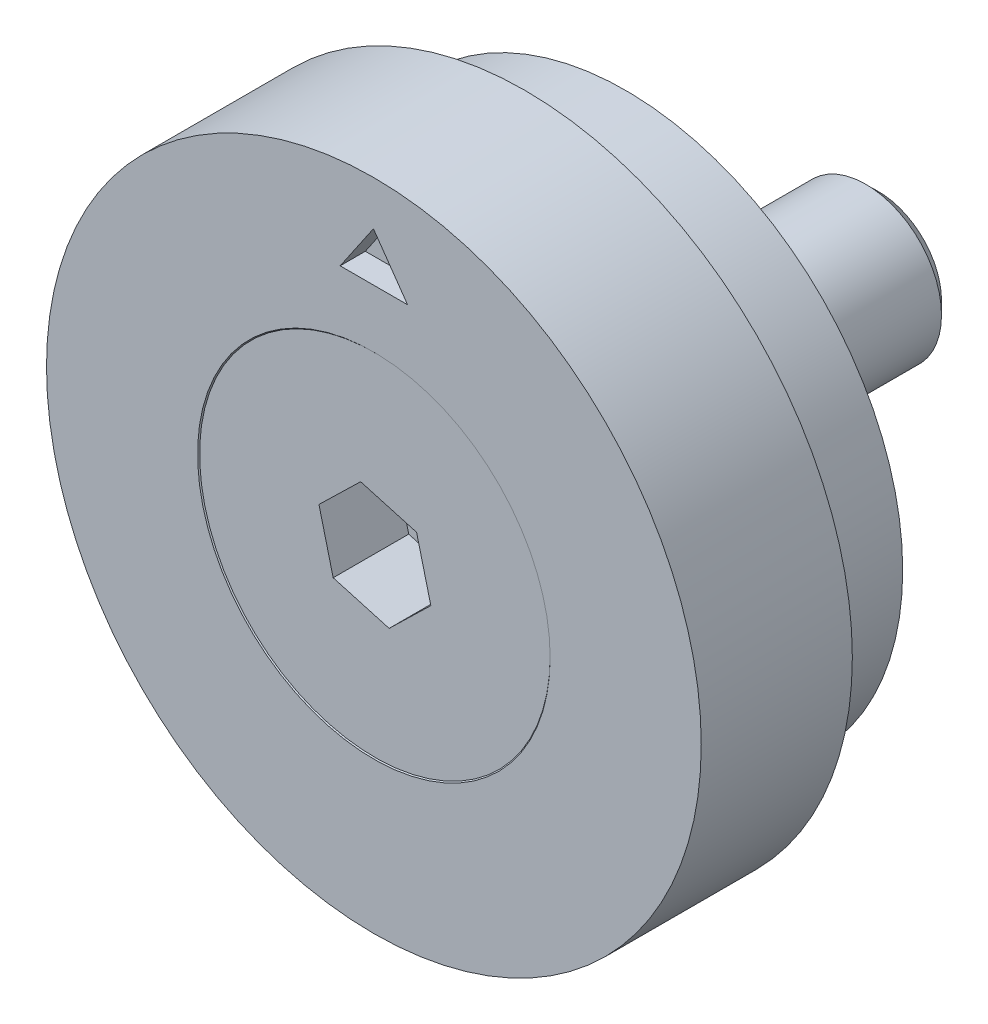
ISO-10303-21;
HEADER;
FILE_DESCRIPTION(('STEP AP214'),'2;1');
FILE_NAME('part.step','',(''),(''),'','','');
FILE_SCHEMA(('AUTOMOTIVE_DESIGN { 1 0 10303 214 1 1 1 1 }'));
ENDSEC;
DATA;
#1=APPLICATION_CONTEXT('core data for automotive mechanical design processes');
#2=APPLICATION_PROTOCOL_DEFINITION('international standard','automotive_design',2000,#1);
#3=PRODUCT_CONTEXT('',#1,'mechanical');
#4=PRODUCT('Part','Part','',(#3));
#5=PRODUCT_RELATED_PRODUCT_CATEGORY('part','',(#4));
#6=PRODUCT_DEFINITION_FORMATION('','',#4);
#7=PRODUCT_DEFINITION_CONTEXT('part definition',#1,'design');
#8=PRODUCT_DEFINITION('design','',#6,#7);
#9=PRODUCT_DEFINITION_SHAPE('','',#8);
#10=(LENGTH_UNIT() NAMED_UNIT(*) SI_UNIT(.MILLI.,.METRE.));
#11=(NAMED_UNIT(*) PLANE_ANGLE_UNIT() SI_UNIT($,.RADIAN.));
#12=(NAMED_UNIT(*) SI_UNIT($,.STERADIAN.) SOLID_ANGLE_UNIT());
#13=UNCERTAINTY_MEASURE_WITH_UNIT(LENGTH_MEASURE(1.E-05),#10,'distance_accuracy_value','');
#14=(GEOMETRIC_REPRESENTATION_CONTEXT(3) GLOBAL_UNCERTAINTY_ASSIGNED_CONTEXT((#13)) GLOBAL_UNIT_ASSIGNED_CONTEXT((#10,
#11,#12)) REPRESENTATION_CONTEXT('',''));
#15=CARTESIAN_POINT('',(0.,0.,0.));
#16=DIRECTION('',(0.,0.,1.));
#17=DIRECTION('',(1.,0.,0.));
#18=AXIS2_PLACEMENT_3D('',#15,#16,#17);
#19=CARTESIAN_POINT('',(0.,0.,-0.0200000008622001));
#20=DIRECTION('',(0.,0.,1.));
#21=DIRECTION('',(1.,0.,0.));
#22=AXIS2_PLACEMENT_3D('',#19,#20,#21);
#23=CYLINDRICAL_SURFACE('',#22,1.5);
#24=CARTESIAN_POINT('',(0.,0.,-2.0000000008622));
#25=DIRECTION('',(0.,0.,1.));
#26=DIRECTION('',(1.,0.,0.));
#27=AXIS2_PLACEMENT_3D('',#24,#25,#26);
#28=CIRCLE('',#27,1.5);
#29=CARTESIAN_POINT('',(1.5,0.,-2.0000000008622));
#30=VERTEX_POINT('',#29);
#31=EDGE_CURVE('P0_E11',#30,#30,#28,.T.);
#32=ORIENTED_EDGE('',*,*,#31,.F.);
#33=EDGE_LOOP('',(#32));
#34=FACE_BOUND('',#33,.T.);
#35=CARTESIAN_POINT('',(0.,0.,-9.7700000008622));
#36=DIRECTION('',(0.,0.,1.));
#37=DIRECTION('',(1.,0.,0.));
#38=AXIS2_PLACEMENT_3D('',#35,#36,#37);
#39=CIRCLE('',#38,1.5);
#40=CARTESIAN_POINT('',(1.5,0.,-9.7700000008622));
#41=VERTEX_POINT('',#40);
#42=EDGE_CURVE('P0_E136',#41,#41,#39,.T.);
#43=ORIENTED_EDGE('',*,*,#42,.T.);
#44=EDGE_LOOP('',(#43));
#45=FACE_BOUND('',#44,.T.);
#46=ADVANCED_FACE('P0_F35',(#34,#45),#23,.T.);
#47=CARTESIAN_POINT('',(0.,0.,-2.0000000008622));
#48=DIRECTION('',(0.,0.,1.));
#49=DIRECTION('',(1.,0.,0.));
#50=AXIS2_PLACEMENT_3D('',#47,#48,#49);
#51=CONICAL_SURFACE('',#50,1.5,0.785398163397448);
#52=CARTESIAN_POINT('',(0.,0.,-0.0200000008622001));
#53=DIRECTION('',(0.,0.,1.));
#54=DIRECTION('',(1.,0.,0.));
#55=AXIS2_PLACEMENT_3D('',#52,#53,#54);
#56=CIRCLE('',#55,3.48);
#57=CARTESIAN_POINT('',(3.48,0.,-0.0200000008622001));
#58=VERTEX_POINT('',#57);
#59=EDGE_CURVE('P0_E42',#58,#58,#56,.T.);
#60=ORIENTED_EDGE('',*,*,#59,.F.);
#61=EDGE_LOOP('',(#60));
#62=FACE_BOUND('',#61,.T.);
#63=ORIENTED_EDGE('',*,*,#31,.T.);
#64=EDGE_LOOP('',(#63));
#65=FACE_BOUND('',#64,.T.);
#66=ADVANCED_FACE('P0_F151',(#62,#65),#51,.T.);
#67=CARTESIAN_POINT('',(0.,3.48,-0.0200000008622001));
#68=DIRECTION('',(0.,0.,-1.));
#69=DIRECTION('',(-1.,0.,0.));
#70=AXIS2_PLACEMENT_3D('',#67,#68,#69);
#71=PLANE('',#70);
#72=DIRECTION('',(0.962144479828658,-0.272539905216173,0.));
#73=VECTOR('',#72,1.);
#74=CARTESIAN_POINT('',(-0.828034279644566,-0.804793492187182,-0.0200000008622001));
#75=LINE('',#74,#73);
#76=CARTESIAN_POINT('',(-0.828034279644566,-0.804793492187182,-0.0200000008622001));
#77=VERTEX_POINT('',#76);
#78=CARTESIAN_POINT('',(0.282954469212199,-1.11949546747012,-0.0200000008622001));
#79=VERTEX_POINT('',#78);
#80=EDGE_CURVE('P0_E123',#77,#79,#75,.T.);
#81=ORIENTED_EDGE('',*,*,#80,.F.);
#82=DIRECTION('',(0.245045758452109,-0.969511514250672,0.));
#83=VECTOR('',#82,1.);
#84=CARTESIAN_POINT('',(-1.11098874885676,0.314701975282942,-0.0200000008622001));
#85=LINE('',#84,#83);
#86=CARTESIAN_POINT('',(-1.11098874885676,0.314701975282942,-0.0200000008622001));
#87=VERTEX_POINT('',#86);
#88=EDGE_CURVE('P0_E49',#87,#77,#85,.T.);
#89=ORIENTED_EDGE('',*,*,#88,.F.);
#90=DIRECTION('',(-0.717098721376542,-0.696971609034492,0.));
#91=VECTOR('',#90,1.);
#92=CARTESIAN_POINT('',(-0.282954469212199,1.11949546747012,-0.0200000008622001));
#93=LINE('',#92,#91);
#94=CARTESIAN_POINT('',(-0.282954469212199,1.11949546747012,-0.0200000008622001));
#95=VERTEX_POINT('',#94);
#96=EDGE_CURVE('P0_E132',#95,#87,#93,.T.);
#97=ORIENTED_EDGE('',*,*,#96,.F.);
#98=DIRECTION('',(-0.962144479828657,0.272539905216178,0.));
#99=VECTOR('',#98,1.);
#100=CARTESIAN_POINT('',(0.828034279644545,0.804793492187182,-0.0200000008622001));
#101=LINE('',#100,#99);
#102=CARTESIAN_POINT('',(0.828034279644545,0.804793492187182,-0.0200000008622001));
#103=VERTEX_POINT('',#102);
#104=EDGE_CURVE('P0_E130',#103,#95,#101,.T.);
#105=ORIENTED_EDGE('',*,*,#104,.F.);
#106=DIRECTION('',(-0.245045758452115,0.96951151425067,0.));
#107=VECTOR('',#106,1.);
#108=CARTESIAN_POINT('',(1.11098874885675,-0.314701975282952,-0.0200000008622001));
#109=LINE('',#108,#107);
#110=CARTESIAN_POINT('',(1.11098874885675,-0.314701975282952,-0.0200000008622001));
#111=VERTEX_POINT('',#110);
#112=EDGE_CURVE('P0_E97',#111,#103,#109,.T.);
#113=ORIENTED_EDGE('',*,*,#112,.F.);
#114=DIRECTION('',(0.717098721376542,0.696971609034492,0.));
#115=VECTOR('',#114,1.);
#116=CARTESIAN_POINT('',(0.282954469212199,-1.11949546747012,-0.0200000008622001));
#117=LINE('',#116,#115);
#118=EDGE_CURVE('P0_E126',#79,#111,#117,.T.);
#119=ORIENTED_EDGE('',*,*,#118,.F.);
#120=EDGE_LOOP('',(#81,#89,#97,#105,#113,#119));
#121=FACE_BOUND('',#120,.T.);
#122=ORIENTED_EDGE('',*,*,#59,.T.);
#123=EDGE_LOOP('',(#122));
#124=FACE_BOUND('',#123,.T.);
#125=ADVANCED_FACE('P0_F149',(#121,#124),#71,.F.);
#126=CARTESIAN_POINT('',(0.,0.,-10.0200000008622));
#127=DIRECTION('',(0.,0.,1.));
#128=DIRECTION('',(1.,0.,0.));
#129=AXIS2_PLACEMENT_3D('',#126,#127,#128);
#130=PLANE('',#129);
#131=CARTESIAN_POINT('',(0.,0.,-10.0200000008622));
#132=DIRECTION('',(0.,0.,1.));
#133=DIRECTION('',(1.,0.,0.));
#134=AXIS2_PLACEMENT_3D('',#131,#132,#133);
#135=CIRCLE('',#134,1.25);
#136=CARTESIAN_POINT('',(1.25,0.,-10.0200000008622));
#137=VERTEX_POINT('',#136);
#138=EDGE_CURVE('P0_E144',#137,#137,#135,.T.);
#139=ORIENTED_EDGE('',*,*,#138,.F.);
#140=EDGE_LOOP('',(#139));
#141=FACE_BOUND('',#140,.T.);
#142=ADVANCED_FACE('P0_F164',(#141),#130,.F.);
#143=CARTESIAN_POINT('',(0.,0.,-10.0200000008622));
#144=DIRECTION('',(0.,0.,1.));
#145=DIRECTION('',(1.,0.,0.));
#146=AXIS2_PLACEMENT_3D('',#143,#144,#145);
#147=CONICAL_SURFACE('',#146,1.25,0.78539816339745);
#148=ORIENTED_EDGE('',*,*,#42,.F.);
#149=EDGE_LOOP('',(#148));
#150=FACE_BOUND('',#149,.T.);
#151=ORIENTED_EDGE('',*,*,#138,.T.);
#152=EDGE_LOOP('',(#151));
#153=FACE_BOUND('',#152,.T.);
#154=ADVANCED_FACE('P0_F160',(#150,#153),#147,.T.);
#155=CARTESIAN_POINT('',(-1.11098874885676,0.314701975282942,-1.5200000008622));
#156=DIRECTION('',(-0.969511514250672,-0.245045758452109,0.));
#157=DIRECTION('',(0.245045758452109,-0.969511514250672,0.));
#158=AXIS2_PLACEMENT_3D('',#155,#156,#157);
#159=PLANE('',#158);
#160=ORIENTED_EDGE('',*,*,#88,.T.);
#161=DIRECTION('',(0.,0.,1.));
#162=VECTOR('',#161,1.);
#163=CARTESIAN_POINT('',(-0.828034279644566,-0.804793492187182,-1.5200000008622));
#164=LINE('',#163,#162);
#165=CARTESIAN_POINT('',(-0.828034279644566,-0.804793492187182,-1.5200000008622));
#166=VERTEX_POINT('',#165);
#167=EDGE_CURVE('P0_E79',#166,#77,#164,.T.);
#168=ORIENTED_EDGE('',*,*,#167,.F.);
#169=DIRECTION('',(0.245045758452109,-0.969511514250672,0.));
#170=VECTOR('',#169,1.);
#171=CARTESIAN_POINT('',(-1.11098874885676,0.314701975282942,-1.5200000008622));
#172=LINE('',#171,#170);
#173=CARTESIAN_POINT('',(-1.11098874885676,0.314701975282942,-1.5200000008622));
#174=VERTEX_POINT('',#173);
#175=EDGE_CURVE('P0_E134',#174,#166,#172,.T.);
#176=ORIENTED_EDGE('',*,*,#175,.F.);
#177=DIRECTION('',(0.,0.,1.));
#178=VECTOR('',#177,1.);
#179=CARTESIAN_POINT('',(-1.11098874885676,0.314701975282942,-1.5200000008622));
#180=LINE('',#179,#178);
#181=EDGE_CURVE('P0_E57',#174,#87,#180,.T.);
#182=ORIENTED_EDGE('',*,*,#181,.T.);
#183=EDGE_LOOP('',(#160,#168,#176,#182));
#184=FACE_BOUND('',#183,.T.);
#185=ADVANCED_FACE('P0_F163',(#184),#159,.F.);
#186=CARTESIAN_POINT('',(-0.282954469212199,1.11949546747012,-1.5200000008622));
#187=DIRECTION('',(-0.696971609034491,0.717098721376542,0.));
#188=DIRECTION('',(-0.717098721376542,-0.696971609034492,0.));
#189=AXIS2_PLACEMENT_3D('',#186,#187,#188);
#190=PLANE('',#189);
#191=ORIENTED_EDGE('',*,*,#96,.T.);
#192=ORIENTED_EDGE('',*,*,#181,.F.);
#193=DIRECTION('',(-0.717098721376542,-0.696971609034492,0.));
#194=VECTOR('',#193,1.);
#195=CARTESIAN_POINT('',(-0.282954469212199,1.11949546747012,-1.5200000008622));
#196=LINE('',#195,#194);
#197=CARTESIAN_POINT('',(-0.282954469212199,1.11949546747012,-1.5200000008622));
#198=VERTEX_POINT('',#197);
#199=EDGE_CURVE('P0_E109',#198,#174,#196,.T.);
#200=ORIENTED_EDGE('',*,*,#199,.F.);
#201=DIRECTION('',(0.,0.,1.));
#202=VECTOR('',#201,1.);
#203=CARTESIAN_POINT('',(-0.282954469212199,1.11949546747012,-1.5200000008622));
#204=LINE('',#203,#202);
#205=EDGE_CURVE('P0_E101',#198,#95,#204,.T.);
#206=ORIENTED_EDGE('',*,*,#205,.T.);
#207=EDGE_LOOP('',(#191,#192,#200,#206));
#208=FACE_BOUND('',#207,.T.);
#209=ADVANCED_FACE('P0_F178',(#208),#190,.F.);
#210=CARTESIAN_POINT('',(0.828034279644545,0.804793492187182,-1.5200000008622));
#211=DIRECTION('',(0.272539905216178,0.962144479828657,0.));
#212=DIRECTION('',(-0.962144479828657,0.272539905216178,0.));
#213=AXIS2_PLACEMENT_3D('',#210,#211,#212);
#214=PLANE('',#213);
#215=ORIENTED_EDGE('',*,*,#104,.T.);
#216=ORIENTED_EDGE('',*,*,#205,.F.);
#217=DIRECTION('',(-0.962144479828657,0.272539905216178,0.));
#218=VECTOR('',#217,1.);
#219=CARTESIAN_POINT('',(0.828034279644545,0.804793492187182,-1.5200000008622));
#220=LINE('',#219,#218);
#221=CARTESIAN_POINT('',(0.828034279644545,0.804793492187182,-1.5200000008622));
#222=VERTEX_POINT('',#221);
#223=EDGE_CURVE('P0_E105',#222,#198,#220,.T.);
#224=ORIENTED_EDGE('',*,*,#223,.F.);
#225=DIRECTION('',(0.,0.,1.));
#226=VECTOR('',#225,1.);
#227=CARTESIAN_POINT('',(0.828034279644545,0.804793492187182,-1.5200000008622));
#228=LINE('',#227,#226);
#229=EDGE_CURVE('P0_E90',#222,#103,#228,.T.);
#230=ORIENTED_EDGE('',*,*,#229,.T.);
#231=EDGE_LOOP('',(#215,#216,#224,#230));
#232=FACE_BOUND('',#231,.T.);
#233=ADVANCED_FACE('P0_F106',(#232),#214,.F.);
#234=CARTESIAN_POINT('',(1.11098874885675,-0.314701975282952,-1.5200000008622));
#235=DIRECTION('',(0.96951151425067,0.245045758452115,0.));
#236=DIRECTION('',(-0.245045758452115,0.96951151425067,0.));
#237=AXIS2_PLACEMENT_3D('',#234,#235,#236);
#238=PLANE('',#237);
#239=ORIENTED_EDGE('',*,*,#112,.T.);
#240=ORIENTED_EDGE('',*,*,#229,.F.);
#241=DIRECTION('',(-0.245045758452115,0.96951151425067,0.));
#242=VECTOR('',#241,1.);
#243=CARTESIAN_POINT('',(1.11098874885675,-0.314701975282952,-1.5200000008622));
#244=LINE('',#243,#242);
#245=CARTESIAN_POINT('',(1.11098874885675,-0.314701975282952,-1.5200000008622));
#246=VERTEX_POINT('',#245);
#247=EDGE_CURVE('P0_E94',#246,#222,#244,.T.);
#248=ORIENTED_EDGE('',*,*,#247,.F.);
#249=DIRECTION('',(0.,0.,1.));
#250=VECTOR('',#249,1.);
#251=CARTESIAN_POINT('',(1.11098874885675,-0.314701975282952,-1.5200000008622));
#252=LINE('',#251,#250);
#253=EDGE_CURVE('P0_E102',#246,#111,#252,.T.);
#254=ORIENTED_EDGE('',*,*,#253,.T.);
#255=EDGE_LOOP('',(#239,#240,#248,#254));
#256=FACE_BOUND('',#255,.T.);
#257=ADVANCED_FACE('P0_F92',(#256),#238,.F.);
#258=CARTESIAN_POINT('',(0.282954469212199,-1.11949546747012,-1.5200000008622));
#259=DIRECTION('',(0.696971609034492,-0.717098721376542,0.));
#260=DIRECTION('',(0.717098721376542,0.696971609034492,0.));
#261=AXIS2_PLACEMENT_3D('',#258,#259,#260);
#262=PLANE('',#261);
#263=ORIENTED_EDGE('',*,*,#118,.T.);
#264=ORIENTED_EDGE('',*,*,#253,.F.);
#265=DIRECTION('',(0.717098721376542,0.696971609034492,0.));
#266=VECTOR('',#265,1.);
#267=CARTESIAN_POINT('',(0.282954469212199,-1.11949546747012,-1.5200000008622));
#268=LINE('',#267,#266);
#269=CARTESIAN_POINT('',(0.282954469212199,-1.11949546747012,-1.5200000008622));
#270=VERTEX_POINT('',#269);
#271=EDGE_CURVE('P0_E115',#270,#246,#268,.T.);
#272=ORIENTED_EDGE('',*,*,#271,.F.);
#273=DIRECTION('',(0.,0.,1.));
#274=VECTOR('',#273,1.);
#275=CARTESIAN_POINT('',(0.282954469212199,-1.11949546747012,-1.5200000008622));
#276=LINE('',#275,#274);
#277=EDGE_CURVE('P0_E139',#270,#79,#276,.T.);
#278=ORIENTED_EDGE('',*,*,#277,.T.);
#279=EDGE_LOOP('',(#263,#264,#272,#278));
#280=FACE_BOUND('',#279,.T.);
#281=ADVANCED_FACE('P0_F182',(#280),#262,.F.);
#282=CARTESIAN_POINT('',(-0.828034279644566,-0.804793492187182,-1.5200000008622));
#283=DIRECTION('',(-0.272539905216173,-0.962144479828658,0.));
#284=DIRECTION('',(0.962144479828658,-0.272539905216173,0.));
#285=AXIS2_PLACEMENT_3D('',#282,#283,#284);
#286=PLANE('',#285);
#287=ORIENTED_EDGE('',*,*,#80,.T.);
#288=ORIENTED_EDGE('',*,*,#277,.F.);
#289=DIRECTION('',(0.962144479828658,-0.272539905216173,0.));
#290=VECTOR('',#289,1.);
#291=CARTESIAN_POINT('',(-0.828034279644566,-0.804793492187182,-1.5200000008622));
#292=LINE('',#291,#290);
#293=EDGE_CURVE('P0_E117',#166,#270,#292,.T.);
#294=ORIENTED_EDGE('',*,*,#293,.F.);
#295=ORIENTED_EDGE('',*,*,#167,.T.);
#296=EDGE_LOOP('',(#287,#288,#294,#295));
#297=FACE_BOUND('',#296,.T.);
#298=ADVANCED_FACE('P0_F179',(#297),#286,.F.);
#299=CARTESIAN_POINT('',(0.,0.,-1.5200000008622));
#300=DIRECTION('',(0.,0.,1.));
#301=DIRECTION('',(1.,0.,0.));
#302=AXIS2_PLACEMENT_3D('',#299,#300,#301);
#303=PLANE('',#302);
#304=ORIENTED_EDGE('',*,*,#175,.T.);
#305=ORIENTED_EDGE('',*,*,#293,.T.);
#306=ORIENTED_EDGE('',*,*,#271,.T.);
#307=ORIENTED_EDGE('',*,*,#247,.T.);
#308=ORIENTED_EDGE('',*,*,#223,.T.);
#309=ORIENTED_EDGE('',*,*,#199,.T.);
#310=EDGE_LOOP('',(#304,#305,#306,#307,#308,#309));
#311=FACE_BOUND('',#310,.T.);
#312=ADVANCED_FACE('P0_F112',(#311),#303,.T.);
#313=CLOSED_SHELL('',(#46,#66,#125,#142,#154,#185,#209,#233,#257,#281,#298,#312));
#314=MANIFOLD_SOLID_BREP('P0_B2',#313);
#315=CARTESIAN_POINT('',(0.,0.,3.12219627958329));
#316=DIRECTION('',(0.,0.,1.));
#317=DIRECTION('',(1.,0.,0.));
#318=AXIS2_PLACEMENT_3D('',#315,#316,#317);
#319=CYLINDRICAL_SURFACE('',#318,6.5);
#320=CARTESIAN_POINT('',(0.,0.,0.));
#321=DIRECTION('',(0.,0.,1.));
#322=DIRECTION('',(1.,0.,0.));
#323=AXIS2_PLACEMENT_3D('',#320,#321,#322);
#324=CIRCLE('',#323,6.5);
#325=CARTESIAN_POINT('',(6.5,0.,0.));
#326=VERTEX_POINT('',#325);
#327=EDGE_CURVE('P1_E11',#326,#326,#324,.T.);
#328=ORIENTED_EDGE('',*,*,#327,.F.);
#329=EDGE_LOOP('',(#328));
#330=FACE_BOUND('',#329,.T.);
#331=CARTESIAN_POINT('',(0.,0.,-3.));
#332=DIRECTION('',(0.,0.,1.));
#333=DIRECTION('',(1.,0.,0.));
#334=AXIS2_PLACEMENT_3D('',#331,#332,#333);
#335=CIRCLE('',#334,6.5);
#336=CARTESIAN_POINT('',(6.5,0.,-3.));
#337=VERTEX_POINT('',#336);
#338=EDGE_CURVE('P1_E75',#337,#337,#335,.T.);
#339=ORIENTED_EDGE('',*,*,#338,.T.);
#340=EDGE_LOOP('',(#339));
#341=FACE_BOUND('',#340,.T.);
#342=ADVANCED_FACE('P1_F16',(#330,#341),#319,.T.);
#343=CARTESIAN_POINT('',(0.,6.5,0.));
#344=DIRECTION('',(0.,0.,-1.));
#345=DIRECTION('',(-1.,0.,0.));
#346=AXIS2_PLACEMENT_3D('',#343,#344,#345);
#347=PLANE('',#346);
#348=DIRECTION('',(-0.573576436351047,0.819152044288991,0.));
#349=VECTOR('',#348,1.);
#350=CARTESIAN_POINT('',(0.669362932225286,4.6482,0.));
#351=LINE('',#350,#349);
#352=CARTESIAN_POINT('',(0.669362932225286,4.6482,0.));
#353=VERTEX_POINT('',#352);
#354=CARTESIAN_POINT('',(-0.00870054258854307,5.616575,0.));
#355=VERTEX_POINT('',#354);
#356=EDGE_CURVE('P1_E68',#353,#355,#351,.T.);
#357=ORIENTED_EDGE('',*,*,#356,.F.);
#358=DIRECTION('',(1.,0.,0.));
#359=VECTOR('',#358,1.);
#360=CARTESIAN_POINT('',(-0.669362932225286,4.6482,0.));
#361=LINE('',#360,#359);
#362=CARTESIAN_POINT('',(-0.669362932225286,4.6482,0.));
#363=VERTEX_POINT('',#362);
#364=EDGE_CURVE('P1_E30',#363,#353,#361,.T.);
#365=ORIENTED_EDGE('',*,*,#364,.F.);
#366=DIRECTION('',(-0.563573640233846,-0.826065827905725,0.));
#367=VECTOR('',#366,1.);
#368=CARTESIAN_POINT('',(-0.00870054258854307,5.616575,0.));
#369=LINE('',#368,#367);
#370=EDGE_CURVE('P1_E66',#355,#363,#369,.T.);
#371=ORIENTED_EDGE('',*,*,#370,.F.);
#372=EDGE_LOOP('',(#357,#365,#371));
#373=FACE_BOUND('',#372,.T.);
#374=CARTESIAN_POINT('',(0.,0.,0.));
#375=DIRECTION('',(0.,0.,1.));
#376=DIRECTION('',(1.,0.,0.));
#377=AXIS2_PLACEMENT_3D('',#374,#375,#376);
#378=CIRCLE('',#377,3.5000000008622);
#379=CARTESIAN_POINT('',(3.5000000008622,0.,0.));
#380=VERTEX_POINT('',#379);
#381=EDGE_CURVE('P1_E23',#380,#380,#378,.T.);
#382=ORIENTED_EDGE('',*,*,#381,.F.);
#383=EDGE_LOOP('',(#382));
#384=FACE_BOUND('',#383,.T.);
#385=ORIENTED_EDGE('',*,*,#327,.T.);
#386=EDGE_LOOP('',(#385));
#387=FACE_BOUND('',#386,.T.);
#388=ADVANCED_FACE('P1_F95',(#373,#384,#387),#347,.F.);
#389=CARTESIAN_POINT('',(0.,0.,0.));
#390=DIRECTION('',(0.,0.,1.));
#391=DIRECTION('',(1.,0.,0.));
#392=AXIS2_PLACEMENT_3D('',#389,#390,#391);
#393=CONICAL_SURFACE('',#392,3.5000000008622,0.785398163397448);
#394=CARTESIAN_POINT('',(0.,0.,-2.0000000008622));
#395=DIRECTION('',(0.,0.,1.));
#396=DIRECTION('',(1.,0.,0.));
#397=AXIS2_PLACEMENT_3D('',#394,#395,#396);
#398=CIRCLE('',#397,1.5);
#399=CARTESIAN_POINT('',(1.5,0.,-2.0000000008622));
#400=VERTEX_POINT('',#399);
#401=EDGE_CURVE('P1_E88',#400,#400,#398,.T.);
#402=ORIENTED_EDGE('',*,*,#401,.F.);
#403=EDGE_LOOP('',(#402));
#404=FACE_BOUND('',#403,.T.);
#405=ORIENTED_EDGE('',*,*,#381,.T.);
#406=EDGE_LOOP('',(#405));
#407=FACE_BOUND('',#406,.T.);
#408=ADVANCED_FACE('P1_F93',(#404,#407),#393,.F.);
#409=CARTESIAN_POINT('',(0.,0.,3.12219627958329));
#410=DIRECTION('',(0.,0.,1.));
#411=DIRECTION('',(1.,0.,0.));
#412=AXIS2_PLACEMENT_3D('',#409,#410,#411);
#413=CYLINDRICAL_SURFACE('',#412,1.5);
#414=CARTESIAN_POINT('',(0.,0.,-5.));
#415=DIRECTION('',(0.,0.,1.));
#416=DIRECTION('',(1.,0.,0.));
#417=AXIS2_PLACEMENT_3D('',#414,#415,#416);
#418=CIRCLE('',#417,1.5);
#419=CARTESIAN_POINT('',(1.5,0.,-5.));
#420=VERTEX_POINT('',#419);
#421=EDGE_CURVE('P1_E85',#420,#420,#418,.T.);
#422=ORIENTED_EDGE('',*,*,#421,.F.);
#423=EDGE_LOOP('',(#422));
#424=FACE_BOUND('',#423,.T.);
#425=ORIENTED_EDGE('',*,*,#401,.T.);
#426=EDGE_LOOP('',(#425));
#427=FACE_BOUND('',#426,.T.);
#428=ADVANCED_FACE('P1_F120',(#424,#427),#413,.F.);
#429=CARTESIAN_POINT('',(0.,1.5,-5.));
#430=DIRECTION('',(0.,0.,1.));
#431=DIRECTION('',(1.,0.,0.));
#432=AXIS2_PLACEMENT_3D('',#429,#430,#431);
#433=PLANE('',#432);
#434=CARTESIAN_POINT('',(0.,0.,-5.));
#435=DIRECTION('',(0.,0.,1.));
#436=DIRECTION('',(1.,0.,0.));
#437=AXIS2_PLACEMENT_3D('',#434,#435,#436);
#438=CIRCLE('',#437,5.5);
#439=CARTESIAN_POINT('',(5.5,0.,-5.));
#440=VERTEX_POINT('',#439);
#441=EDGE_CURVE('P1_E82',#440,#440,#438,.T.);
#442=ORIENTED_EDGE('',*,*,#441,.F.);
#443=EDGE_LOOP('',(#442));
#444=FACE_BOUND('',#443,.T.);
#445=ORIENTED_EDGE('',*,*,#421,.T.);
#446=EDGE_LOOP('',(#445));
#447=FACE_BOUND('',#446,.T.);
#448=ADVANCED_FACE('P1_F114',(#444,#447),#433,.F.);
#449=CARTESIAN_POINT('',(0.,0.,3.12219627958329));
#450=DIRECTION('',(0.,0.,1.));
#451=DIRECTION('',(1.,0.,0.));
#452=AXIS2_PLACEMENT_3D('',#449,#450,#451);
#453=CYLINDRICAL_SURFACE('',#452,5.5);
#454=CARTESIAN_POINT('',(0.,0.,-3.));
#455=DIRECTION('',(0.,0.,1.));
#456=DIRECTION('',(1.,0.,0.));
#457=AXIS2_PLACEMENT_3D('',#454,#455,#456);
#458=CIRCLE('',#457,5.5);
#459=CARTESIAN_POINT('',(5.5,0.,-3.));
#460=VERTEX_POINT('',#459);
#461=EDGE_CURVE('P1_E79',#460,#460,#458,.T.);
#462=ORIENTED_EDGE('',*,*,#461,.F.);
#463=EDGE_LOOP('',(#462));
#464=FACE_BOUND('',#463,.T.);
#465=ORIENTED_EDGE('',*,*,#441,.T.);
#466=EDGE_LOOP('',(#465));
#467=FACE_BOUND('',#466,.T.);
#468=ADVANCED_FACE('P1_F108',(#464,#467),#453,.T.);
#469=CARTESIAN_POINT('',(0.,5.5,-3.));
#470=DIRECTION('',(0.,0.,1.));
#471=DIRECTION('',(1.,0.,0.));
#472=AXIS2_PLACEMENT_3D('',#469,#470,#471);
#473=PLANE('',#472);
#474=ORIENTED_EDGE('',*,*,#338,.F.);
#475=EDGE_LOOP('',(#474));
#476=FACE_BOUND('',#475,.T.);
#477=ORIENTED_EDGE('',*,*,#461,.T.);
#478=EDGE_LOOP('',(#477));
#479=FACE_BOUND('',#478,.T.);
#480=ADVANCED_FACE('P1_F105',(#476,#479),#473,.F.);
#481=CARTESIAN_POINT('',(-0.669362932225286,4.6482,-0.5));
#482=DIRECTION('',(0.,-1.,0.));
#483=DIRECTION('',(0.,0.,-1.));
#484=AXIS2_PLACEMENT_3D('',#481,#482,#483);
#485=PLANE('',#484);
#486=ORIENTED_EDGE('',*,*,#364,.T.);
#487=DIRECTION('',(0.,0.,1.));
#488=VECTOR('',#487,1.);
#489=CARTESIAN_POINT('',(0.669362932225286,4.6482,-0.5));
#490=LINE('',#489,#488);
#491=CARTESIAN_POINT('',(0.669362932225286,4.6482,-0.5));
#492=VERTEX_POINT('',#491);
#493=EDGE_CURVE('P1_E48',#492,#353,#490,.T.);
#494=ORIENTED_EDGE('',*,*,#493,.F.);
#495=DIRECTION('',(1.,0.,0.));
#496=VECTOR('',#495,1.);
#497=CARTESIAN_POINT('',(-0.669362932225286,4.6482,-0.5));
#498=LINE('',#497,#496);
#499=CARTESIAN_POINT('',(-0.669362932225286,4.6482,-0.5));
#500=VERTEX_POINT('',#499);
#501=EDGE_CURVE('P1_E52',#500,#492,#498,.T.);
#502=ORIENTED_EDGE('',*,*,#501,.F.);
#503=DIRECTION('',(0.,0.,1.));
#504=VECTOR('',#503,1.);
#505=CARTESIAN_POINT('',(-0.669362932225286,4.6482,-0.5));
#506=LINE('',#505,#504);
#507=EDGE_CURVE('P1_E38',#500,#363,#506,.T.);
#508=ORIENTED_EDGE('',*,*,#507,.T.);
#509=EDGE_LOOP('',(#486,#494,#502,#508));
#510=FACE_BOUND('',#509,.T.);
#511=ADVANCED_FACE('P1_F50',(#510),#485,.F.);
#512=CARTESIAN_POINT('',(-0.00870054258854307,5.616575,-0.5));
#513=DIRECTION('',(-0.826065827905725,0.563573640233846,0.));
#514=DIRECTION('',(-0.563573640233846,-0.826065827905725,0.));
#515=AXIS2_PLACEMENT_3D('',#512,#513,#514);
#516=PLANE('',#515);
#517=ORIENTED_EDGE('',*,*,#370,.T.);
#518=ORIENTED_EDGE('',*,*,#507,.F.);
#519=DIRECTION('',(-0.563573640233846,-0.826065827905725,0.));
#520=VECTOR('',#519,1.);
#521=CARTESIAN_POINT('',(-0.00870054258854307,5.616575,-0.5));
#522=LINE('',#521,#520);
#523=CARTESIAN_POINT('',(-0.00870054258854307,5.616575,-0.5));
#524=VERTEX_POINT('',#523);
#525=EDGE_CURVE('P1_E58',#524,#500,#522,.T.);
#526=ORIENTED_EDGE('',*,*,#525,.F.);
#527=DIRECTION('',(0.,0.,1.));
#528=VECTOR('',#527,1.);
#529=CARTESIAN_POINT('',(-0.00870054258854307,5.616575,-0.5));
#530=LINE('',#529,#528);
#531=EDGE_CURVE('P1_E57',#524,#355,#530,.T.);
#532=ORIENTED_EDGE('',*,*,#531,.T.);
#533=EDGE_LOOP('',(#517,#518,#526,#532));
#534=FACE_BOUND('',#533,.T.);
#535=ADVANCED_FACE('P1_F138',(#534),#516,.F.);
#536=CARTESIAN_POINT('',(0.669362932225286,4.6482,-0.5));
#537=DIRECTION('',(0.819152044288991,0.573576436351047,0.));
#538=DIRECTION('',(-0.573576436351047,0.819152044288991,0.));
#539=AXIS2_PLACEMENT_3D('',#536,#537,#538);
#540=PLANE('',#539);
#541=ORIENTED_EDGE('',*,*,#356,.T.);
#542=ORIENTED_EDGE('',*,*,#531,.F.);
#543=DIRECTION('',(-0.573576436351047,0.819152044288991,0.));
#544=VECTOR('',#543,1.);
#545=CARTESIAN_POINT('',(0.669362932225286,4.6482,-0.5));
#546=LINE('',#545,#544);
#547=EDGE_CURVE('P1_E61',#492,#524,#546,.T.);
#548=ORIENTED_EDGE('',*,*,#547,.F.);
#549=ORIENTED_EDGE('',*,*,#493,.T.);
#550=EDGE_LOOP('',(#541,#542,#548,#549));
#551=FACE_BOUND('',#550,.T.);
#552=ADVANCED_FACE('P1_F62',(#551),#540,.F.);
#553=CARTESIAN_POINT('',(-0.669362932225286,4.6482,-0.5));
#554=DIRECTION('',(0.,0.,-1.));
#555=DIRECTION('',(-1.,0.,0.));
#556=AXIS2_PLACEMENT_3D('',#553,#554,#555);
#557=PLANE('',#556);
#558=ORIENTED_EDGE('',*,*,#501,.T.);
#559=ORIENTED_EDGE('',*,*,#547,.T.);
#560=ORIENTED_EDGE('',*,*,#525,.T.);
#561=EDGE_LOOP('',(#558,#559,#560));
#562=FACE_BOUND('',#561,.T.);
#563=ADVANCED_FACE('P1_F65',(#562),#557,.F.);
#564=CLOSED_SHELL('',(#342,#388,#408,#428,#448,#468,#480,#511,#535,#552,#563));
#565=MANIFOLD_SOLID_BREP('P1_B1',#564);
#566=ADVANCED_BREP_SHAPE_REPRESENTATION('',(#18,#314,#565),#14);
#567=SHAPE_DEFINITION_REPRESENTATION(#9,#566);
ENDSEC;
END-ISO-10303-21;
